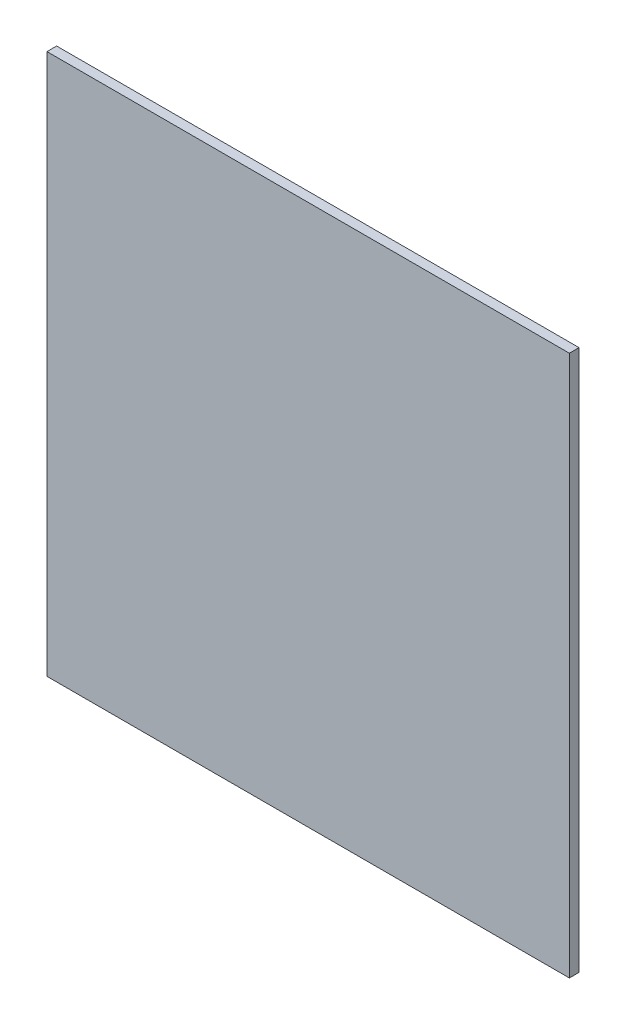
ISO-10303-21;
HEADER;
FILE_DESCRIPTION(('STEP AP214'),'2;1');
FILE_NAME('part.step','',(''),(''),'','','');
FILE_SCHEMA(('AUTOMOTIVE_DESIGN { 1 0 10303 214 1 1 1 1 }'));
ENDSEC;
DATA;
#1=APPLICATION_CONTEXT('core data for automotive mechanical design processes');
#2=APPLICATION_PROTOCOL_DEFINITION('international standard','automotive_design',2000,#1);
#3=PRODUCT_CONTEXT('',#1,'mechanical');
#4=PRODUCT('Part','Part','',(#3));
#5=PRODUCT_RELATED_PRODUCT_CATEGORY('part','',(#4));
#6=PRODUCT_DEFINITION_FORMATION('','',#4);
#7=PRODUCT_DEFINITION_CONTEXT('part definition',#1,'design');
#8=PRODUCT_DEFINITION('design','',#6,#7);
#9=PRODUCT_DEFINITION_SHAPE('','',#8);
#10=(LENGTH_UNIT() NAMED_UNIT(*) SI_UNIT(.MILLI.,.METRE.));
#11=(NAMED_UNIT(*) PLANE_ANGLE_UNIT() SI_UNIT($,.RADIAN.));
#12=(NAMED_UNIT(*) SI_UNIT($,.STERADIAN.) SOLID_ANGLE_UNIT());
#13=UNCERTAINTY_MEASURE_WITH_UNIT(LENGTH_MEASURE(1.E-05),#10,'distance_accuracy_value','');
#14=(GEOMETRIC_REPRESENTATION_CONTEXT(3) GLOBAL_UNCERTAINTY_ASSIGNED_CONTEXT((#13)) GLOBAL_UNIT_ASSIGNED_CONTEXT((#10,
#11,#12)) REPRESENTATION_CONTEXT('',''));
#15=CARTESIAN_POINT('',(0.,0.,0.));
#16=DIRECTION('',(0.,0.,1.));
#17=DIRECTION('',(1.,0.,0.));
#18=AXIS2_PLACEMENT_3D('',#15,#16,#17);
#19=CARTESIAN_POINT('',(-346.16048926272,336.550000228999,279.400000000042));
#20=DIRECTION('',(-1.,0.,0.));
#21=DIRECTION('',(0.,1.,0.));
#22=AXIS2_PLACEMENT_3D('',#19,#20,#21);
#23=PLANE('',#22);
#24=DIRECTION('',(0.,0.,1.));
#25=VECTOR('',#24,1.);
#26=CARTESIAN_POINT('',(-346.160489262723,355.6,9.4264108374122E-13));
#27=LINE('',#26,#25);
#28=CARTESIAN_POINT('',(-346.160489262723,355.6,-12.6999999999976));
#29=VERTEX_POINT('',#28);
#30=CARTESIAN_POINT('',(-346.160489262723,355.6,2.41878470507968E-12));
#31=VERTEX_POINT('',#30);
#32=EDGE_CURVE('E43',#29,#31,#27,.T.);
#33=ORIENTED_EDGE('',*,*,#32,.F.);
#34=DIRECTION('',(0.,1.,0.));
#35=VECTOR('',#34,1.);
#36=CARTESIAN_POINT('',(-346.160489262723,355.600000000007,-12.6999999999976));
#37=LINE('',#36,#35);
#38=CARTESIAN_POINT('',(-346.160489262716,-355.6,-12.7));
#39=VERTEX_POINT('',#38);
#40=EDGE_CURVE('E105',#39,#29,#37,.T.);
#41=ORIENTED_EDGE('',*,*,#40,.F.);
#42=DIRECTION('',(0.,0.,-1.));
#43=VECTOR('',#42,1.);
#44=CARTESIAN_POINT('',(-346.160489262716,-355.6,9.42641083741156E-13));
#45=LINE('',#44,#43);
#46=CARTESIAN_POINT('',(-346.160489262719,-355.6,2.41878470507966E-12));
#47=VERTEX_POINT('',#46);
#48=EDGE_CURVE('E56',#47,#39,#45,.T.);
#49=ORIENTED_EDGE('',*,*,#48,.F.);
#50=DIRECTION('',(0.,-1.,0.));
#51=VECTOR('',#50,1.);
#52=CARTESIAN_POINT('',(-346.160489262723,355.600000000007,2.41878470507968E-12));
#53=LINE('',#52,#51);
#54=EDGE_CURVE('E50',#31,#47,#53,.T.);
#55=ORIENTED_EDGE('',*,*,#54,.F.);
#56=EDGE_LOOP('',(#33,#41,#49,#55));
#57=FACE_BOUND('',#56,.T.);
#58=ADVANCED_FACE('F36',(#57),#23,.T.);
#59=CARTESIAN_POINT('',(-1063.82387308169,355.6,7.43343331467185E-12));
#60=DIRECTION('',(0.,0.,1.));
#61=DIRECTION('',(1.,0.,0.));
#62=AXIS2_PLACEMENT_3D('',#59,#60,#61);
#63=PLANE('',#62);
#64=DIRECTION('',(1.,0.,0.));
#65=VECTOR('',#64,1.);
#66=CARTESIAN_POINT('',(-1063.82387308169,355.6,7.43343331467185E-12));
#67=LINE('',#66,#65);
#68=CARTESIAN_POINT('',(340.521689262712,355.6,-2.37938378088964E-12));
#69=VERTEX_POINT('',#68);
#70=EDGE_CURVE('E12',#31,#69,#67,.T.);
#71=ORIENTED_EDGE('',*,*,#70,.F.);
#72=ORIENTED_EDGE('',*,*,#54,.T.);
#73=DIRECTION('',(1.,0.,0.));
#74=VECTOR('',#73,1.);
#75=CARTESIAN_POINT('',(-1063.82387308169,-355.6,7.43343331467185E-12));
#76=LINE('',#75,#74);
#77=CARTESIAN_POINT('',(340.521689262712,-355.6,-2.37938378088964E-12));
#78=VERTEX_POINT('',#77);
#79=EDGE_CURVE('E92',#47,#78,#76,.T.);
#80=ORIENTED_EDGE('',*,*,#79,.T.);
#81=DIRECTION('',(0.,-1.,0.));
#82=VECTOR('',#81,1.);
#83=CARTESIAN_POINT('',(340.521689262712,355.6,-2.37938378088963E-12));
#84=LINE('',#83,#82);
#85=EDGE_CURVE('E90',#69,#78,#84,.T.);
#86=ORIENTED_EDGE('',*,*,#85,.F.);
#87=EDGE_LOOP('',(#71,#72,#80,#86));
#88=FACE_BOUND('',#87,.T.);
#89=ADVANCED_FACE('F91',(#88),#63,.T.);
#90=CARTESIAN_POINT('',(-1063.82387308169,-355.6,7.43343331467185E-12));
#91=DIRECTION('',(0.,-1.,0.));
#92=DIRECTION('',(1.,0.,0.));
#93=AXIS2_PLACEMENT_3D('',#90,#91,#92);
#94=PLANE('',#93);
#95=ORIENTED_EDGE('',*,*,#79,.F.);
#96=ORIENTED_EDGE('',*,*,#48,.T.);
#97=DIRECTION('',(1.,0.,0.));
#98=VECTOR('',#97,1.);
#99=CARTESIAN_POINT('',(-1063.82387308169,-355.6,-12.6999999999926));
#100=LINE('',#99,#98);
#101=CARTESIAN_POINT('',(340.521689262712,-355.6,-12.7000000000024));
#102=VERTEX_POINT('',#101);
#103=EDGE_CURVE('E77',#39,#102,#100,.T.);
#104=ORIENTED_EDGE('',*,*,#103,.T.);
#105=DIRECTION('',(0.,0.,-1.));
#106=VECTOR('',#105,1.);
#107=CARTESIAN_POINT('',(340.521689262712,-355.6,-6.8679907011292E-12));
#108=LINE('',#107,#106);
#109=EDGE_CURVE('E95',#78,#102,#108,.T.);
#110=ORIENTED_EDGE('',*,*,#109,.F.);
#111=EDGE_LOOP('',(#95,#96,#104,#110));
#112=FACE_BOUND('',#111,.T.);
#113=ADVANCED_FACE('F109',(#112),#94,.T.);
#114=CARTESIAN_POINT('',(-1063.82387308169,355.6,-12.6999999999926));
#115=DIRECTION('',(0.,0.,-1.));
#116=DIRECTION('',(-1.,0.,0.));
#117=AXIS2_PLACEMENT_3D('',#114,#115,#116);
#118=PLANE('',#117);
#119=ORIENTED_EDGE('',*,*,#103,.F.);
#120=ORIENTED_EDGE('',*,*,#40,.T.);
#121=DIRECTION('',(1.,0.,0.));
#122=VECTOR('',#121,1.);
#123=CARTESIAN_POINT('',(-1063.82387308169,355.6,-12.6999999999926));
#124=LINE('',#123,#122);
#125=CARTESIAN_POINT('',(340.521689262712,355.6,-12.7000000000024));
#126=VERTEX_POINT('',#125);
#127=EDGE_CURVE('E69',#29,#126,#124,.T.);
#128=ORIENTED_EDGE('',*,*,#127,.T.);
#129=DIRECTION('',(0.,1.,0.));
#130=VECTOR('',#129,1.);
#131=CARTESIAN_POINT('',(340.521689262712,355.6,-12.7000000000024));
#132=LINE('',#131,#130);
#133=EDGE_CURVE('E98',#102,#126,#132,.T.);
#134=ORIENTED_EDGE('',*,*,#133,.F.);
#135=EDGE_LOOP('',(#119,#120,#128,#134));
#136=FACE_BOUND('',#135,.T.);
#137=ADVANCED_FACE('F111',(#136),#118,.T.);
#138=CARTESIAN_POINT('',(-1063.82387308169,355.6,7.43343331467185E-12));
#139=DIRECTION('',(0.,1.,0.));
#140=DIRECTION('',(-1.,0.,0.));
#141=AXIS2_PLACEMENT_3D('',#138,#139,#140);
#142=PLANE('',#141);
#143=ORIENTED_EDGE('',*,*,#127,.F.);
#144=ORIENTED_EDGE('',*,*,#32,.T.);
#145=ORIENTED_EDGE('',*,*,#70,.T.);
#146=DIRECTION('',(0.,0.,1.));
#147=VECTOR('',#146,1.);
#148=CARTESIAN_POINT('',(340.521689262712,355.6,-6.8679907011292E-12));
#149=LINE('',#148,#147);
#150=EDGE_CURVE('E86',#126,#69,#149,.T.);
#151=ORIENTED_EDGE('',*,*,#150,.F.);
#152=EDGE_LOOP('',(#143,#144,#145,#151));
#153=FACE_BOUND('',#152,.T.);
#154=ADVANCED_FACE('F84',(#153),#142,.T.);
#155=CARTESIAN_POINT('',(340.521689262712,-355.6,-2.38232500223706E-12));
#156=DIRECTION('',(1.,0.,0.));
#157=DIRECTION('',(0.,0.,-1.));
#158=AXIS2_PLACEMENT_3D('',#155,#156,#157);
#159=PLANE('',#158);
#160=ORIENTED_EDGE('',*,*,#133,.T.);
#161=ORIENTED_EDGE('',*,*,#150,.T.);
#162=ORIENTED_EDGE('',*,*,#85,.T.);
#163=ORIENTED_EDGE('',*,*,#109,.T.);
#164=EDGE_LOOP('',(#160,#161,#162,#163));
#165=FACE_BOUND('',#164,.T.);
#166=ADVANCED_FACE('F97',(#165),#159,.T.);
#167=CLOSED_SHELL('',(#58,#89,#113,#137,#154,#166));
#168=MANIFOLD_SOLID_BREP('B2',#167);
#169=ADVANCED_BREP_SHAPE_REPRESENTATION('',(#18,#168),#14);
#170=SHAPE_DEFINITION_REPRESENTATION(#9,#169);
ENDSEC;
END-ISO-10303-21;
